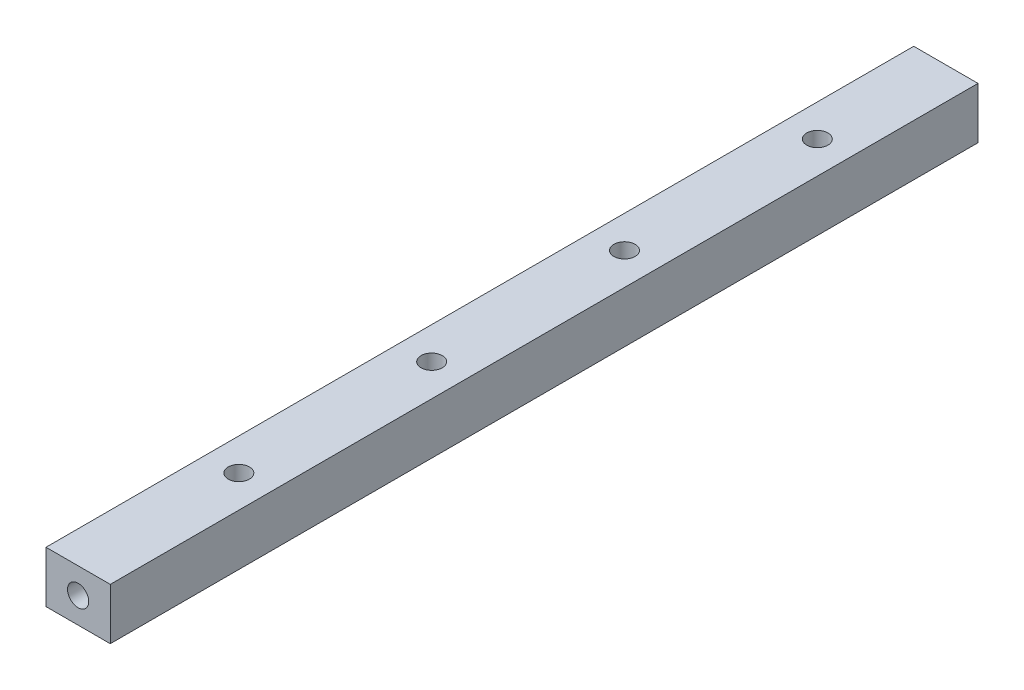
from build123d import *

# Parameters (mm, degrees)
ESQUISSE1_W                = 10
ESQUISSE1_H                = 8
BOSS_EXTRU_1_DEPTH         = 135
TROU_TARAUD_M41_D          = 3.3
TROU_TARAUD_M41_DEPTH      = 20
TROU_TARAUD_M41_TIP        = 0.991420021
TROU_TARAUD_M42_D          = 3.3
R_P_TITION_LIN_AIRE1_COUNT = 4
R_P_TITION_LIN_AIRE1_PITCH = 30


with BuildPart() as part:
    # Esquisse1 → Boss.-Extru.1 (new body)
    with BuildSketch(Plane.XY):
        Rectangle(ESQUISSE1_W, ESQUISSE1_H)
    extrude(amount=BOSS_EXTRU_1_DEPTH)

    # Trou taraud_ M41
    with Locations(Plane.XY.offset(135)):
        with Locations((0, 0)):
            Hole(TROU_TARAUD_M41_D / 2, depth=TROU_TARAUD_M41_DEPTH)
            with Locations((0, 0, -(TROU_TARAUD_M41_DEPTH + TROU_TARAUD_M41_TIP / 2))):  # 118° drill point
                Cone(0, TROU_TARAUD_M41_D / 2, TROU_TARAUD_M41_TIP, mode=Mode.SUBTRACT)

    # Trou taraud_ M42 (through all)
    with Locations(Plane(origin=(0, 4, 0), x_dir=(-1, 0, 0), z_dir=(0, 1, 0))):
        with Locations((0, 20)):
            trou_taraud_m42 = Hole(TROU_TARAUD_M42_D / 2)

    # R_p_tition lin_aire1: Trou taraud_ M42 ×4
    with Locations(*[(0, 0, i * R_P_TITION_LIN_AIRE1_PITCH) for i in range(1, R_P_TITION_LIN_AIRE1_COUNT)]):
        add(trou_taraud_m42, mode=Mode.SUBTRACT)


solid = part.part
